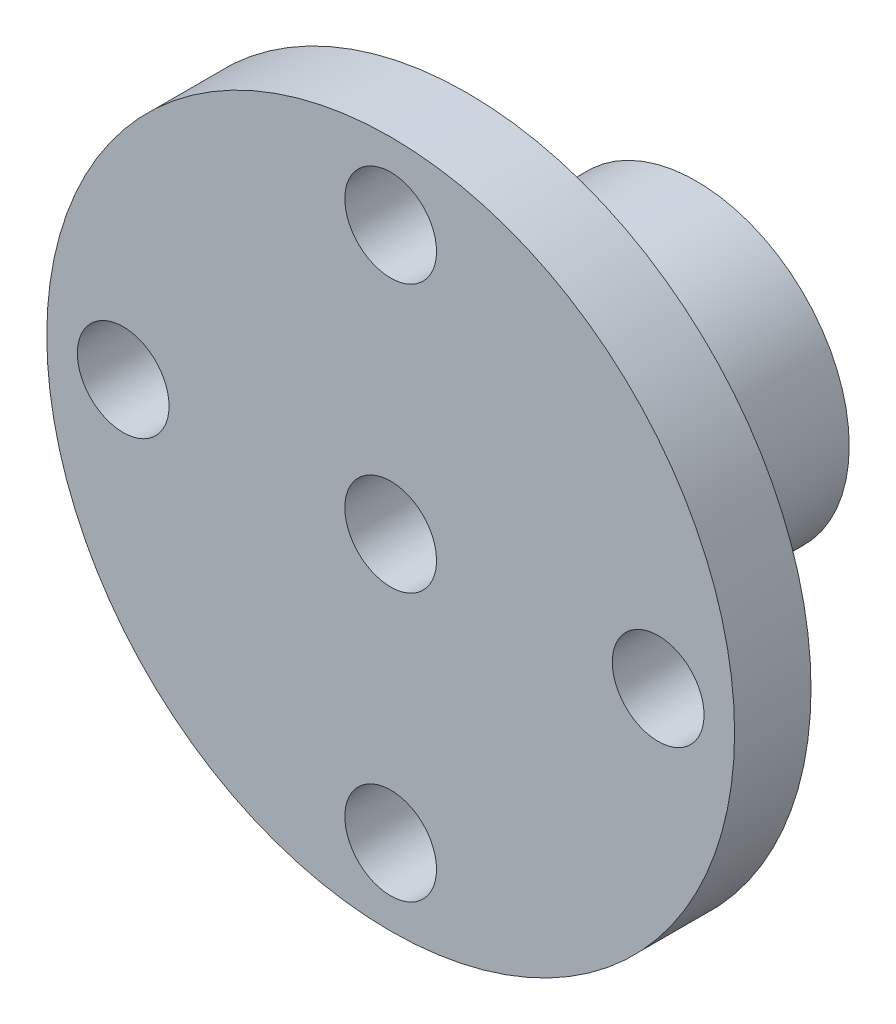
from build123d import *

# Parameters (mm, degrees)
SKETCH1_R           = 22.5
SKETCH1_R_2         = 3
BOSS_EXTRUDE1_DEPTH = 5
SKETCH2_R           = 10
BOSS_EXTRUDE2_DEPTH = 15
SKETCH3_R           = 3
CUT_EXTRUDE1_DEPTH  = 20


with BuildPart() as part:
    # Sketch1 → Boss-Extrude1 (new body)
    with BuildSketch(Plane.XY):
        Circle(SKETCH1_R)
        with Locations((0, 17.506698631)):
            Circle(SKETCH1_R_2, mode=Mode.SUBTRACT)
        with Locations((17.5, 0)):
            Circle(SKETCH1_R_2, mode=Mode.SUBTRACT)
        with Locations((0, -17.5)):
            Circle(SKETCH1_R_2, mode=Mode.SUBTRACT)
        with Locations((-17.5, 0)):
            Circle(SKETCH1_R_2, mode=Mode.SUBTRACT)
    extrude(amount=BOSS_EXTRUDE1_DEPTH)

    # Sketch2 → Boss-Extrude2 (add)
    with BuildSketch(Plane(origin=(0, 0, 0), x_dir=(-1, 0, 0), z_dir=(0, 0, -1))):
        with Locations(Location((0, 0, 0), (0, 0, 180))):
            Circle(SKETCH2_R)
    extrude(amount=BOSS_EXTRUDE2_DEPTH)

    # Sketch3 → Cut-Extrude1 (cut)
    with BuildSketch(Plane(origin=(0, 0, -15), x_dir=(-1, 0, 0), z_dir=(0, 0, -1))):
        Circle(SKETCH3_R)
    extrude(amount=-CUT_EXTRUDE1_DEPTH, mode=Mode.SUBTRACT)


solid = part.part
